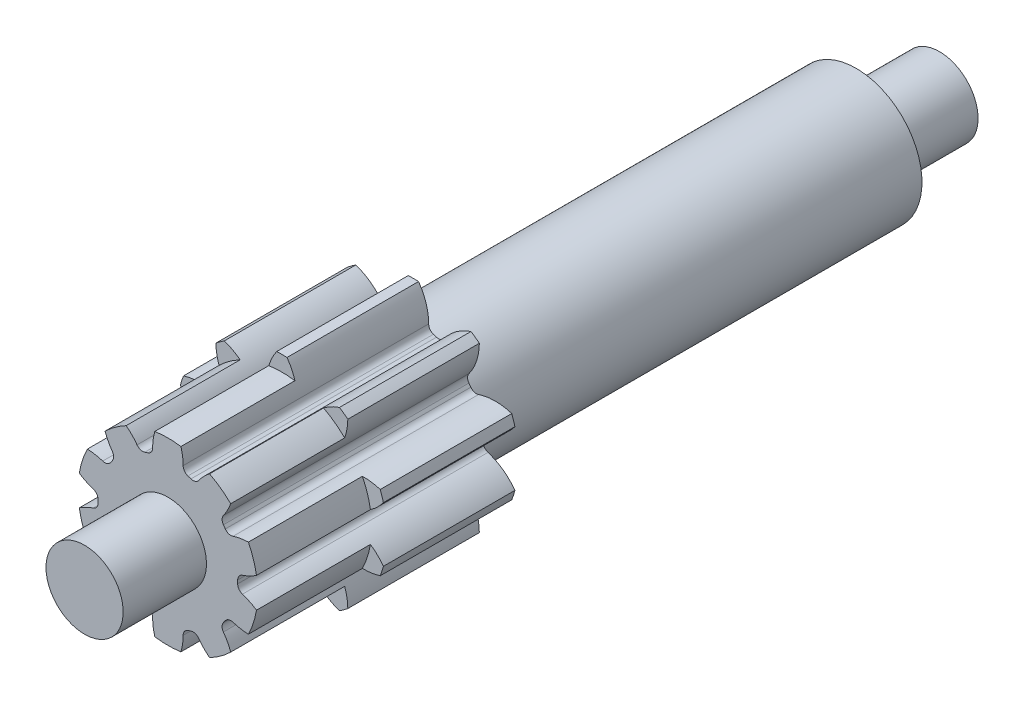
from build123d import *

# Parameters (mm, degrees)
BOSS_EXTRUDE1_DEPTH      = 4.875
BOSS_EXTRUDE1_DEPTH_BACK = 4.875
SKETCH3_R                = 1.2
CUT_EXTRUDE1_DEPTH       = 6.161940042
FILLET1_R                = 0.078539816
CIRPATTERN1_COUNT        = 10
FILLET1_OF_CIRPATTERN1_R = 0.078539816


with BuildPart() as part:
    # Sketch3 → Boss-Extrude1 (new, two sides: drawn at the far end of the back side and taken through both)
    with BuildSketch(Plane.XY.offset(-BOSS_EXTRUDE1_DEPTH_BACK)):
        Circle(SKETCH3_R)
    extrude(amount=BOSS_EXTRUDE1_DEPTH + BOSS_EXTRUDE1_DEPTH_BACK)

    # Sketch4 → Cut-Extrude1 (cut, symmetric)
    with BuildSketch(Plane.XY):
        with BuildLine():
            Line((0.796135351, -0.078539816), (0.796135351, 0.078539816))
            ThreePointArc((0.796135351, 0.078539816), (0.998479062, 0.163721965), (1.158053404, 0.314503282))
            ThreePointArc((1.158053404, 0.314503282), (1.2, 0), (1.158053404, -0.314503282))
            ThreePointArc((1.158053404, -0.314503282), (0.998479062, -0.163721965), (0.796135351, -0.078539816))
        make_face()
    cut_extrude1 = extrude(amount=CUT_EXTRUDE1_DEPTH, both=True, mode=Mode.SUBTRACT)

    # Fillet1
    fillet1_edges = [part.edges().sort_by_distance(p)[0] for p in [
        (0.796135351, 0.078539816, 0),
        (0.796135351, -0.078539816, 0),
    ]]
    fillet(fillet1_edges, radius=FILLET1_R)

    # CirPattern1: Cut-Extrude1 ×10 about axis
    cirpattern1_axis = Axis((0, 0, 0), (0, 0, 1))
    for i in range(1, CIRPATTERN1_COUNT):
        add(cut_extrude1.rotate(cirpattern1_axis, i * 360 / CIRPATTERN1_COUNT), mode=Mode.SUBTRACT)

    # Fillet1 of CirPattern1
    fillet1_of_cirpattern1_edges = [part.edges().sort_by_distance(p)[0] for p in [
        (0.597922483, 0.531496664, 0),
        (0.690251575, 0.404416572, 0),
        (0.171323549, 0.781439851, 0),
        (0.320715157, 0.732899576, 0),
        (-0.320715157, 0.732899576, 0),
        (-0.171323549, 0.781439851, 0),
        (-0.690251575, 0.404416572, 0),
        (-0.597922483, 0.531496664, 0),
        (-0.796135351, -0.078539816, 0),
        (-0.796135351, 0.078539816, 0),
        (-0.597922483, -0.531496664, 0),
        (-0.690251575, -0.404416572, 0),
        (-0.171323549, -0.781439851, 0),
        (-0.320715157, -0.732899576, 0),
        (0.320715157, -0.732899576, 0),
        (0.171323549, -0.781439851, 0),
        (0.690251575, -0.404416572, 0),
        (0.597922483, -0.531496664, 0),
    ]]
    fillet(fillet1_of_cirpattern1_edges, radius=FILLET1_OF_CIRPATTERN1_R)

    # Sketch6 → Cut-Revolve1 (revolve, cut)
    with BuildSketch(Plane(origin=(0, 0, 0), x_dir=(1, 0, 0), z_dir=(0, 1, 0))):
        Polygon((-0.44, 4.875), (-1.3, 4.875), (-1.3, -1.125), (-0.75, -1.125), (-0.75, 3.925), (-0.44, 3.925), align=None)
        Polygon((-1.3, -2.625), (-1.3, -4.875), (-0.44, -4.875), (-0.44, -3.925), (-1.025, -3.925), (-1.025, -2.625), align=None)
    revolve(axis=Axis((0, 0, -6.2826103), (0, 0, 1)), mode=Mode.SUBTRACT)


solid = part.part
